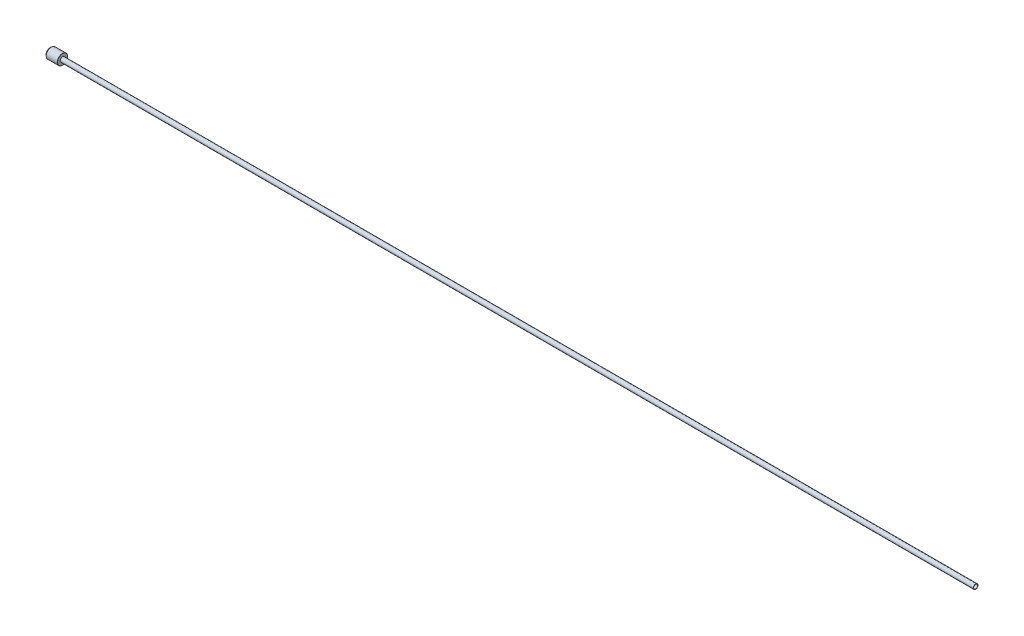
from build123d import *

# Parameters (mm, degrees)
FILLET1_R = 0.1


with BuildPart() as part:
    # Sketch1 → Revolve1 (revolve)
    with BuildSketch(Plane.XY, mode=Mode.PRIVATE) as revolve1_sk:
        Polygon((0.55, 2.5), (5, 2.5), (6, 2.5), (6, 1.143), (450, 1.143), (450, 0.9652), (0, 0.9652), (0, 2.05), (0.1, 2.05), align=None)
    revolve(revolve1_sk.sketch.rotate(Axis((-22.212185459, 0, 0), (1, 0, 0)), 90), axis=Axis((-22.212185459, 0, 0), (1, 0, 0)))

    # Fillet1
    fillet1_edges = [part.edges().sort_by_distance(p)[0] for p in [
        (6, 0, -2.5),
    ]]
    fillet(fillet1_edges, radius=FILLET1_R)


solid = part.part
